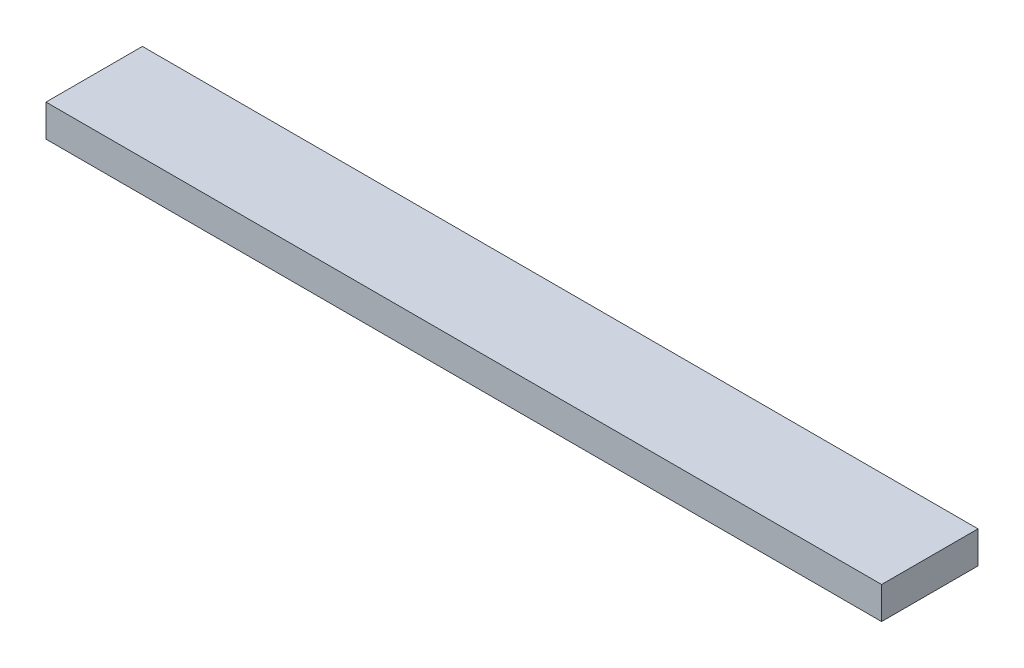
ISO-10303-21;
HEADER;
FILE_DESCRIPTION(('STEP AP214'),'2;1');
FILE_NAME('part.step','',(''),(''),'','','');
FILE_SCHEMA(('AUTOMOTIVE_DESIGN { 1 0 10303 214 1 1 1 1 }'));
ENDSEC;
DATA;
#1=APPLICATION_CONTEXT('core data for automotive mechanical design processes');
#2=APPLICATION_PROTOCOL_DEFINITION('international standard','automotive_design',2000,#1);
#3=PRODUCT_CONTEXT('',#1,'mechanical');
#4=PRODUCT('Part','Part','',(#3));
#5=PRODUCT_RELATED_PRODUCT_CATEGORY('part','',(#4));
#6=PRODUCT_DEFINITION_FORMATION('','',#4);
#7=PRODUCT_DEFINITION_CONTEXT('part definition',#1,'design');
#8=PRODUCT_DEFINITION('design','',#6,#7);
#9=PRODUCT_DEFINITION_SHAPE('','',#8);
#10=(LENGTH_UNIT() NAMED_UNIT(*) SI_UNIT(.MILLI.,.METRE.));
#11=(NAMED_UNIT(*) PLANE_ANGLE_UNIT() SI_UNIT($,.RADIAN.));
#12=(NAMED_UNIT(*) SI_UNIT($,.STERADIAN.) SOLID_ANGLE_UNIT());
#13=UNCERTAINTY_MEASURE_WITH_UNIT(LENGTH_MEASURE(1.E-05),#10,'distance_accuracy_value','');
#14=(GEOMETRIC_REPRESENTATION_CONTEXT(3) GLOBAL_UNCERTAINTY_ASSIGNED_CONTEXT((#13)) GLOBAL_UNIT_ASSIGNED_CONTEXT((#10,
#11,#12)) REPRESENTATION_CONTEXT('',''));
#15=CARTESIAN_POINT('',(0.,0.,0.));
#16=DIRECTION('',(0.,0.,1.));
#17=DIRECTION('',(1.,0.,0.));
#18=AXIS2_PLACEMENT_3D('',#15,#16,#17);
#19=CARTESIAN_POINT('',(0.,3.175,0.));
#20=DIRECTION('',(1.,0.,0.));
#21=DIRECTION('',(0.,0.,-1.));
#22=AXIS2_PLACEMENT_3D('',#19,#20,#21);
#23=PLANE('',#22);
#24=DIRECTION('',(0.,0.,1.));
#25=VECTOR('',#24,1.);
#26=CARTESIAN_POINT('',(0.,0.,0.));
#27=LINE('',#26,#25);
#28=CARTESIAN_POINT('',(0.,0.,-9.525));
#29=VERTEX_POINT('',#28);
#30=CARTESIAN_POINT('',(0.,0.,0.));
#31=VERTEX_POINT('',#30);
#32=EDGE_CURVE('E98',#29,#31,#27,.T.);
#33=ORIENTED_EDGE('',*,*,#32,.T.);
#34=DIRECTION('',(0.,-1.,0.));
#35=VECTOR('',#34,1.);
#36=CARTESIAN_POINT('',(0.,3.175,0.));
#37=LINE('',#36,#35);
#38=CARTESIAN_POINT('',(0.,3.175,0.));
#39=VERTEX_POINT('',#38);
#40=EDGE_CURVE('E11',#39,#31,#37,.T.);
#41=ORIENTED_EDGE('',*,*,#40,.F.);
#42=DIRECTION('',(0.,0.,1.));
#43=VECTOR('',#42,1.);
#44=CARTESIAN_POINT('',(0.,3.175,0.));
#45=LINE('',#44,#43);
#46=CARTESIAN_POINT('',(0.,3.175,-9.525));
#47=VERTEX_POINT('',#46);
#48=EDGE_CURVE('E86',#47,#39,#45,.T.);
#49=ORIENTED_EDGE('',*,*,#48,.F.);
#50=DIRECTION('',(0.,-1.,0.));
#51=VECTOR('',#50,1.);
#52=CARTESIAN_POINT('',(0.,3.175,-9.525));
#53=LINE('',#52,#51);
#54=EDGE_CURVE('E94',#47,#29,#53,.T.);
#55=ORIENTED_EDGE('',*,*,#54,.T.);
#56=EDGE_LOOP('',(#33,#41,#49,#55));
#57=FACE_BOUND('',#56,.T.);
#58=ADVANCED_FACE('F35',(#57),#23,.F.);
#59=CARTESIAN_POINT('',(0.,3.175,0.));
#60=DIRECTION('',(0.,0.,-1.));
#61=DIRECTION('',(-1.,0.,0.));
#62=AXIS2_PLACEMENT_3D('',#59,#60,#61);
#63=PLANE('',#62);
#64=DIRECTION('',(1.,0.,0.));
#65=VECTOR('',#64,1.);
#66=CARTESIAN_POINT('',(0.,0.,0.));
#67=LINE('',#66,#65);
#68=CARTESIAN_POINT('',(82.55,0.,0.));
#69=VERTEX_POINT('',#68);
#70=EDGE_CURVE('E90',#31,#69,#67,.T.);
#71=ORIENTED_EDGE('',*,*,#70,.T.);
#72=DIRECTION('',(0.,-1.,0.));
#73=VECTOR('',#72,1.);
#74=CARTESIAN_POINT('',(82.55,3.175,0.));
#75=LINE('',#74,#73);
#76=CARTESIAN_POINT('',(82.55,3.175,0.));
#77=VERTEX_POINT('',#76);
#78=EDGE_CURVE('E43',#77,#69,#75,.T.);
#79=ORIENTED_EDGE('',*,*,#78,.F.);
#80=DIRECTION('',(1.,0.,0.));
#81=VECTOR('',#80,1.);
#82=CARTESIAN_POINT('',(0.,3.175,0.));
#83=LINE('',#82,#81);
#84=EDGE_CURVE('E81',#39,#77,#83,.T.);
#85=ORIENTED_EDGE('',*,*,#84,.F.);
#86=ORIENTED_EDGE('',*,*,#40,.T.);
#87=EDGE_LOOP('',(#71,#79,#85,#86));
#88=FACE_BOUND('',#87,.T.);
#89=ADVANCED_FACE('F89',(#88),#63,.F.);
#90=CARTESIAN_POINT('',(82.55,3.175,0.));
#91=DIRECTION('',(-1.,0.,0.));
#92=DIRECTION('',(0.,0.,1.));
#93=AXIS2_PLACEMENT_3D('',#90,#91,#92);
#94=PLANE('',#93);
#95=DIRECTION('',(0.,0.,-1.));
#96=VECTOR('',#95,1.);
#97=CARTESIAN_POINT('',(82.55,0.,0.));
#98=LINE('',#97,#96);
#99=CARTESIAN_POINT('',(82.55,0.,-9.525));
#100=VERTEX_POINT('',#99);
#101=EDGE_CURVE('E68',#69,#100,#98,.T.);
#102=ORIENTED_EDGE('',*,*,#101,.T.);
#103=DIRECTION('',(0.,-1.,0.));
#104=VECTOR('',#103,1.);
#105=CARTESIAN_POINT('',(82.55,3.175,-9.525));
#106=LINE('',#105,#104);
#107=CARTESIAN_POINT('',(82.55,3.175,-9.525));
#108=VERTEX_POINT('',#107);
#109=EDGE_CURVE('E91',#108,#100,#106,.T.);
#110=ORIENTED_EDGE('',*,*,#109,.F.);
#111=DIRECTION('',(0.,0.,-1.));
#112=VECTOR('',#111,1.);
#113=CARTESIAN_POINT('',(82.55,3.175,0.));
#114=LINE('',#113,#112);
#115=EDGE_CURVE('E84',#77,#108,#114,.T.);
#116=ORIENTED_EDGE('',*,*,#115,.F.);
#117=ORIENTED_EDGE('',*,*,#78,.T.);
#118=EDGE_LOOP('',(#102,#110,#116,#117));
#119=FACE_BOUND('',#118,.T.);
#120=ADVANCED_FACE('F92',(#119),#94,.F.);
#121=CARTESIAN_POINT('',(0.,3.175,-9.525));
#122=DIRECTION('',(0.,0.,1.));
#123=DIRECTION('',(1.,0.,0.));
#124=AXIS2_PLACEMENT_3D('',#121,#122,#123);
#125=PLANE('',#124);
#126=DIRECTION('',(-1.,0.,0.));
#127=VECTOR('',#126,1.);
#128=CARTESIAN_POINT('',(0.,0.,-9.525));
#129=LINE('',#128,#127);
#130=EDGE_CURVE('E74',#100,#29,#129,.T.);
#131=ORIENTED_EDGE('',*,*,#130,.T.);
#132=ORIENTED_EDGE('',*,*,#54,.F.);
#133=DIRECTION('',(-1.,0.,0.));
#134=VECTOR('',#133,1.);
#135=CARTESIAN_POINT('',(0.,3.175,-9.525));
#136=LINE('',#135,#134);
#137=EDGE_CURVE('E51',#108,#47,#136,.T.);
#138=ORIENTED_EDGE('',*,*,#137,.F.);
#139=ORIENTED_EDGE('',*,*,#109,.T.);
#140=EDGE_LOOP('',(#131,#132,#138,#139));
#141=FACE_BOUND('',#140,.T.);
#142=ADVANCED_FACE('F105',(#141),#125,.F.);
#143=CARTESIAN_POINT('',(0.,3.175,0.));
#144=DIRECTION('',(0.,-1.,0.));
#145=DIRECTION('',(0.,0.,-1.));
#146=AXIS2_PLACEMENT_3D('',#143,#144,#145);
#147=PLANE('',#146);
#148=ORIENTED_EDGE('',*,*,#48,.T.);
#149=ORIENTED_EDGE('',*,*,#84,.T.);
#150=ORIENTED_EDGE('',*,*,#115,.T.);
#151=ORIENTED_EDGE('',*,*,#137,.T.);
#152=EDGE_LOOP('',(#148,#149,#150,#151));
#153=FACE_BOUND('',#152,.T.);
#154=ADVANCED_FACE('F82',(#153),#147,.F.);
#155=CARTESIAN_POINT('',(0.,0.,0.));
#156=DIRECTION('',(0.,-1.,0.));
#157=DIRECTION('',(0.,0.,-1.));
#158=AXIS2_PLACEMENT_3D('',#155,#156,#157);
#159=PLANE('',#158);
#160=ORIENTED_EDGE('',*,*,#32,.F.);
#161=ORIENTED_EDGE('',*,*,#130,.F.);
#162=ORIENTED_EDGE('',*,*,#101,.F.);
#163=ORIENTED_EDGE('',*,*,#70,.F.);
#164=EDGE_LOOP('',(#160,#161,#162,#163));
#165=FACE_BOUND('',#164,.T.);
#166=ADVANCED_FACE('F108',(#165),#159,.T.);
#167=CLOSED_SHELL('',(#58,#89,#120,#142,#154,#166));
#168=MANIFOLD_SOLID_BREP('B2',#167);
#169=ADVANCED_BREP_SHAPE_REPRESENTATION('',(#18,#168),#14);
#170=SHAPE_DEFINITION_REPRESENTATION(#9,#169);
ENDSEC;
END-ISO-10303-21;
